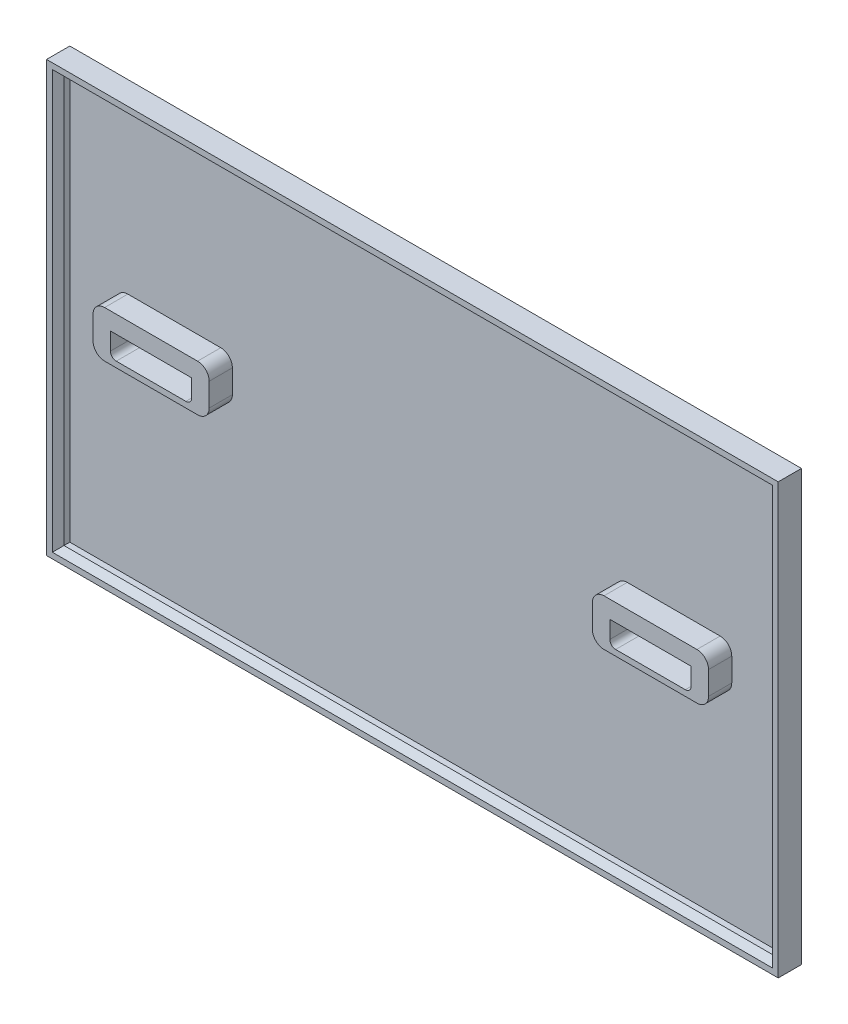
ISO-10303-21;
HEADER;
FILE_DESCRIPTION(('STEP AP214'),'2;1');
FILE_NAME('part.step','',(''),(''),'','','');
FILE_SCHEMA(('AUTOMOTIVE_DESIGN { 1 0 10303 214 1 1 1 1 }'));
ENDSEC;
DATA;
#1=APPLICATION_CONTEXT('core data for automotive mechanical design processes');
#2=APPLICATION_PROTOCOL_DEFINITION('international standard','automotive_design',2000,#1);
#3=PRODUCT_CONTEXT('',#1,'mechanical');
#4=PRODUCT('Part','Part','',(#3));
#5=PRODUCT_RELATED_PRODUCT_CATEGORY('part','',(#4));
#6=PRODUCT_DEFINITION_FORMATION('','',#4);
#7=PRODUCT_DEFINITION_CONTEXT('part definition',#1,'design');
#8=PRODUCT_DEFINITION('design','',#6,#7);
#9=PRODUCT_DEFINITION_SHAPE('','',#8);
#10=(LENGTH_UNIT() NAMED_UNIT(*) SI_UNIT(.MILLI.,.METRE.));
#11=(NAMED_UNIT(*) PLANE_ANGLE_UNIT() SI_UNIT($,.RADIAN.));
#12=(NAMED_UNIT(*) SI_UNIT($,.STERADIAN.) SOLID_ANGLE_UNIT());
#13=UNCERTAINTY_MEASURE_WITH_UNIT(LENGTH_MEASURE(1.E-05),#10,'distance_accuracy_value','');
#14=(GEOMETRIC_REPRESENTATION_CONTEXT(3) GLOBAL_UNCERTAINTY_ASSIGNED_CONTEXT((#13)) GLOBAL_UNIT_ASSIGNED_CONTEXT((#10,
#11,#12)) REPRESENTATION_CONTEXT('',''));
#15=CARTESIAN_POINT('',(0.,0.,0.));
#16=DIRECTION('',(0.,0.,1.));
#17=DIRECTION('',(1.,0.,0.));
#18=AXIS2_PLACEMENT_3D('',#15,#16,#17);
#19=CARTESIAN_POINT('',(0.,-370.,10.));
#20=DIRECTION('',(0.,0.,1.));
#21=DIRECTION('',(1.,0.,0.));
#22=AXIS2_PLACEMENT_3D('',#19,#20,#21);
#23=PLANE('',#22);
#24=DIRECTION('',(0.,1.,0.));
#25=VECTOR('',#24,1.);
#26=CARTESIAN_POINT('',(150.,-160.,10.));
#27=LINE('',#26,#25);
#28=CARTESIAN_POINT('',(150.,-180.,10.));
#29=VERTEX_POINT('',#28);
#30=CARTESIAN_POINT('',(150.,-160.,10.));
#31=VERTEX_POINT('',#30);
#32=EDGE_CURVE('E482',#29,#31,#27,.T.);
#33=ORIENTED_EDGE('',*,*,#32,.F.);
#34=CARTESIAN_POINT('',(140.,-180.,10.));
#35=DIRECTION('',(0.,0.,1.));
#36=DIRECTION('',(-1.,0.,0.));
#37=AXIS2_PLACEMENT_3D('',#34,#35,#36);
#38=CIRCLE('',#37,10.);
#39=CARTESIAN_POINT('',(140.,-190.,10.));
#40=VERTEX_POINT('',#39);
#41=EDGE_CURVE('E460',#40,#29,#38,.T.);
#42=ORIENTED_EDGE('',*,*,#41,.F.);
#43=DIRECTION('',(1.,0.,0.));
#44=VECTOR('',#43,1.);
#45=CARTESIAN_POINT('',(60.,-190.,10.));
#46=LINE('',#45,#44);
#47=CARTESIAN_POINT('',(60.,-190.,10.));
#48=VERTEX_POINT('',#47);
#49=EDGE_CURVE('E465',#48,#40,#46,.T.);
#50=ORIENTED_EDGE('',*,*,#49,.F.);
#51=CARTESIAN_POINT('',(60.,-180.,10.));
#52=DIRECTION('',(0.,0.,1.));
#53=DIRECTION('',(1.,0.,0.));
#54=AXIS2_PLACEMENT_3D('',#51,#52,#53);
#55=CIRCLE('',#54,10.);
#56=CARTESIAN_POINT('',(50.,-180.,10.));
#57=VERTEX_POINT('',#56);
#58=EDGE_CURVE('E492',#57,#48,#55,.T.);
#59=ORIENTED_EDGE('',*,*,#58,.F.);
#60=DIRECTION('',(0.,-1.,0.));
#61=VECTOR('',#60,1.);
#62=CARTESIAN_POINT('',(50.,-160.,10.));
#63=LINE('',#62,#61);
#64=CARTESIAN_POINT('',(50.,-160.,10.));
#65=VERTEX_POINT('',#64);
#66=EDGE_CURVE('E490',#65,#57,#63,.T.);
#67=ORIENTED_EDGE('',*,*,#66,.F.);
#68=CARTESIAN_POINT('',(60.,-160.,10.));
#69=DIRECTION('',(0.,0.,1.));
#70=DIRECTION('',(1.,0.,0.));
#71=AXIS2_PLACEMENT_3D('',#68,#69,#70);
#72=CIRCLE('',#71,10.);
#73=CARTESIAN_POINT('',(60.,-150.,10.));
#74=VERTEX_POINT('',#73);
#75=EDGE_CURVE('E488',#74,#65,#72,.T.);
#76=ORIENTED_EDGE('',*,*,#75,.F.);
#77=DIRECTION('',(-1.,0.,0.));
#78=VECTOR('',#77,1.);
#79=CARTESIAN_POINT('',(60.,-150.,10.));
#80=LINE('',#79,#78);
#81=CARTESIAN_POINT('',(140.,-150.,10.));
#82=VERTEX_POINT('',#81);
#83=EDGE_CURVE('E486',#82,#74,#80,.T.);
#84=ORIENTED_EDGE('',*,*,#83,.F.);
#85=CARTESIAN_POINT('',(140.,-160.,10.));
#86=DIRECTION('',(0.,0.,1.));
#87=DIRECTION('',(1.,0.,0.));
#88=AXIS2_PLACEMENT_3D('',#85,#86,#87);
#89=CIRCLE('',#88,10.);
#90=EDGE_CURVE('E484',#31,#82,#89,.T.);
#91=ORIENTED_EDGE('',*,*,#90,.F.);
#92=EDGE_LOOP('',(#33,#42,#50,#59,#67,#76,#84,#91));
#93=FACE_BOUND('',#92,.T.);
#94=DIRECTION('',(0.,-1.,0.));
#95=VECTOR('',#94,1.);
#96=CARTESIAN_POINT('',(10.,0.,10.));
#97=LINE('',#96,#95);
#98=CARTESIAN_POINT('',(10.,-10.,10.));
#99=VERTEX_POINT('',#98);
#100=CARTESIAN_POINT('',(10.,-360.,10.));
#101=VERTEX_POINT('',#100);
#102=EDGE_CURVE('E550',#99,#101,#97,.T.);
#103=ORIENTED_EDGE('',*,*,#102,.T.);
#104=DIRECTION('',(1.,0.,0.));
#105=VECTOR('',#104,1.);
#106=CARTESIAN_POINT('',(0.,-360.,10.));
#107=LINE('',#106,#105);
#108=CARTESIAN_POINT('',(620.,-360.,10.));
#109=VERTEX_POINT('',#108);
#110=EDGE_CURVE('E553',#101,#109,#107,.T.);
#111=ORIENTED_EDGE('',*,*,#110,.T.);
#112=DIRECTION('',(0.,1.,0.));
#113=VECTOR('',#112,1.);
#114=CARTESIAN_POINT('',(620.,0.,10.));
#115=LINE('',#114,#113);
#116=CARTESIAN_POINT('',(620.,-10.,10.));
#117=VERTEX_POINT('',#116);
#118=EDGE_CURVE('E564',#109,#117,#115,.T.);
#119=ORIENTED_EDGE('',*,*,#118,.T.);
#120=DIRECTION('',(-1.,0.,0.));
#121=VECTOR('',#120,1.);
#122=CARTESIAN_POINT('',(0.,-10.,10.));
#123=LINE('',#122,#121);
#124=EDGE_CURVE('E561',#117,#99,#123,.T.);
#125=ORIENTED_EDGE('',*,*,#124,.T.);
#126=EDGE_LOOP('',(#103,#111,#119,#125));
#127=FACE_BOUND('',#126,.T.);
#128=DIRECTION('',(0.,1.,0.));
#129=VECTOR('',#128,1.);
#130=CARTESIAN_POINT('',(580.,-160.,10.));
#131=LINE('',#130,#129);
#132=CARTESIAN_POINT('',(580.,-180.,10.));
#133=VERTEX_POINT('',#132);
#134=CARTESIAN_POINT('',(580.,-160.,10.));
#135=VERTEX_POINT('',#134);
#136=EDGE_CURVE('E425',#133,#135,#131,.T.);
#137=ORIENTED_EDGE('',*,*,#136,.F.);
#138=CARTESIAN_POINT('',(570.,-180.,10.));
#139=DIRECTION('',(0.,0.,1.));
#140=DIRECTION('',(-1.,0.,0.));
#141=AXIS2_PLACEMENT_3D('',#138,#139,#140);
#142=CIRCLE('',#141,9.99999999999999);
#143=CARTESIAN_POINT('',(570.,-190.,10.));
#144=VERTEX_POINT('',#143);
#145=EDGE_CURVE('E394',#144,#133,#142,.T.);
#146=ORIENTED_EDGE('',*,*,#145,.F.);
#147=DIRECTION('',(1.,0.,0.));
#148=VECTOR('',#147,1.);
#149=CARTESIAN_POINT('',(490.,-190.,10.));
#150=LINE('',#149,#148);
#151=CARTESIAN_POINT('',(490.,-190.,10.));
#152=VERTEX_POINT('',#151);
#153=EDGE_CURVE('E408',#152,#144,#150,.T.);
#154=ORIENTED_EDGE('',*,*,#153,.F.);
#155=CARTESIAN_POINT('',(490.,-180.,10.));
#156=DIRECTION('',(0.,0.,1.));
#157=DIRECTION('',(1.,0.,0.));
#158=AXIS2_PLACEMENT_3D('',#155,#156,#157);
#159=CIRCLE('',#158,10.);
#160=CARTESIAN_POINT('',(480.,-180.,10.));
#161=VERTEX_POINT('',#160);
#162=EDGE_CURVE('E435',#161,#152,#159,.T.);
#163=ORIENTED_EDGE('',*,*,#162,.F.);
#164=DIRECTION('',(0.,-1.,0.));
#165=VECTOR('',#164,1.);
#166=CARTESIAN_POINT('',(480.,-160.,10.));
#167=LINE('',#166,#165);
#168=CARTESIAN_POINT('',(480.,-160.,10.));
#169=VERTEX_POINT('',#168);
#170=EDGE_CURVE('E433',#169,#161,#167,.T.);
#171=ORIENTED_EDGE('',*,*,#170,.F.);
#172=CARTESIAN_POINT('',(490.,-160.,10.));
#173=DIRECTION('',(0.,0.,1.));
#174=DIRECTION('',(-1.,0.,0.));
#175=AXIS2_PLACEMENT_3D('',#172,#173,#174);
#176=CIRCLE('',#175,9.99999999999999);
#177=CARTESIAN_POINT('',(490.,-150.,10.));
#178=VERTEX_POINT('',#177);
#179=EDGE_CURVE('E431',#178,#169,#176,.T.);
#180=ORIENTED_EDGE('',*,*,#179,.F.);
#181=DIRECTION('',(-1.,0.,0.));
#182=VECTOR('',#181,1.);
#183=CARTESIAN_POINT('',(490.,-150.,10.));
#184=LINE('',#183,#182);
#185=CARTESIAN_POINT('',(570.,-150.,10.));
#186=VERTEX_POINT('',#185);
#187=EDGE_CURVE('E429',#186,#178,#184,.T.);
#188=ORIENTED_EDGE('',*,*,#187,.F.);
#189=CARTESIAN_POINT('',(570.,-160.,10.));
#190=DIRECTION('',(0.,0.,1.));
#191=DIRECTION('',(1.,0.,0.));
#192=AXIS2_PLACEMENT_3D('',#189,#190,#191);
#193=CIRCLE('',#192,10.);
#194=EDGE_CURVE('E427',#135,#186,#193,.T.);
#195=ORIENTED_EDGE('',*,*,#194,.F.);
#196=EDGE_LOOP('',(#137,#146,#154,#163,#171,#180,#188,#195));
#197=FACE_BOUND('',#196,.T.);
#198=ADVANCED_FACE('F33',(#93,#127,#197),#23,.T.);
#199=CARTESIAN_POINT('',(0.,0.,20.));
#200=DIRECTION('',(1.,0.,0.));
#201=DIRECTION('',(0.,1.,0.));
#202=AXIS2_PLACEMENT_3D('',#199,#200,#201);
#203=PLANE('',#202);
#204=DIRECTION('',(0.,-1.,0.));
#205=VECTOR('',#204,1.);
#206=CARTESIAN_POINT('',(0.,0.,0.));
#207=LINE('',#206,#205);
#208=CARTESIAN_POINT('',(0.,0.,0.));
#209=VERTEX_POINT('',#208);
#210=CARTESIAN_POINT('',(0.,-370.,0.));
#211=VERTEX_POINT('',#210);
#212=EDGE_CURVE('E556',#209,#211,#207,.T.);
#213=ORIENTED_EDGE('',*,*,#212,.T.);
#214=DIRECTION('',(0.,0.,-1.));
#215=VECTOR('',#214,1.);
#216=CARTESIAN_POINT('',(0.,-370.,20.));
#217=LINE('',#216,#215);
#218=CARTESIAN_POINT('',(0.,-370.,20.));
#219=VERTEX_POINT('',#218);
#220=EDGE_CURVE('E597',#219,#211,#217,.T.);
#221=ORIENTED_EDGE('',*,*,#220,.F.);
#222=DIRECTION('',(0.,-1.,0.));
#223=VECTOR('',#222,1.);
#224=CARTESIAN_POINT('',(0.,0.,20.));
#225=LINE('',#224,#223);
#226=CARTESIAN_POINT('',(0.,0.,20.));
#227=VERTEX_POINT('',#226);
#228=EDGE_CURVE('E571',#227,#219,#225,.T.);
#229=ORIENTED_EDGE('',*,*,#228,.F.);
#230=DIRECTION('',(0.,0.,-1.));
#231=VECTOR('',#230,1.);
#232=CARTESIAN_POINT('',(0.,0.,20.));
#233=LINE('',#232,#231);
#234=EDGE_CURVE('E581',#227,#209,#233,.T.);
#235=ORIENTED_EDGE('',*,*,#234,.T.);
#236=EDGE_LOOP('',(#213,#221,#229,#235));
#237=FACE_BOUND('',#236,.T.);
#238=ADVANCED_FACE('F672',(#237),#203,.F.);
#239=CARTESIAN_POINT('',(0.,-370.,20.));
#240=DIRECTION('',(0.,1.,0.));
#241=DIRECTION('',(0.,0.,1.));
#242=AXIS2_PLACEMENT_3D('',#239,#240,#241);
#243=PLANE('',#242);
#244=DIRECTION('',(1.,0.,0.));
#245=VECTOR('',#244,1.);
#246=CARTESIAN_POINT('',(0.,-370.,0.));
#247=LINE('',#246,#245);
#248=CARTESIAN_POINT('',(630.,-370.,0.));
#249=VERTEX_POINT('',#248);
#250=EDGE_CURVE('E584',#211,#249,#247,.T.);
#251=ORIENTED_EDGE('',*,*,#250,.T.);
#252=DIRECTION('',(0.,0.,-1.));
#253=VECTOR('',#252,1.);
#254=CARTESIAN_POINT('',(630.,-370.,20.));
#255=LINE('',#254,#253);
#256=CARTESIAN_POINT('',(630.,-370.,20.));
#257=VERTEX_POINT('',#256);
#258=EDGE_CURVE('E594',#257,#249,#255,.T.);
#259=ORIENTED_EDGE('',*,*,#258,.F.);
#260=DIRECTION('',(1.,0.,0.));
#261=VECTOR('',#260,1.);
#262=CARTESIAN_POINT('',(0.,-370.,20.));
#263=LINE('',#262,#261);
#264=EDGE_CURVE('E574',#219,#257,#263,.T.);
#265=ORIENTED_EDGE('',*,*,#264,.F.);
#266=ORIENTED_EDGE('',*,*,#220,.T.);
#267=EDGE_LOOP('',(#251,#259,#265,#266));
#268=FACE_BOUND('',#267,.T.);
#269=ADVANCED_FACE('F678',(#268),#243,.F.);
#270=CARTESIAN_POINT('',(630.,0.,20.));
#271=DIRECTION('',(-1.,0.,0.));
#272=DIRECTION('',(0.,0.,1.));
#273=AXIS2_PLACEMENT_3D('',#270,#271,#272);
#274=PLANE('',#273);
#275=DIRECTION('',(0.,1.,0.));
#276=VECTOR('',#275,1.);
#277=CARTESIAN_POINT('',(630.,0.,0.));
#278=LINE('',#277,#276);
#279=CARTESIAN_POINT('',(630.,0.,0.));
#280=VERTEX_POINT('',#279);
#281=EDGE_CURVE('E586',#249,#280,#278,.T.);
#282=ORIENTED_EDGE('',*,*,#281,.T.);
#283=DIRECTION('',(0.,0.,-1.));
#284=VECTOR('',#283,1.);
#285=CARTESIAN_POINT('',(630.,0.,20.));
#286=LINE('',#285,#284);
#287=CARTESIAN_POINT('',(630.,0.,20.));
#288=VERTEX_POINT('',#287);
#289=EDGE_CURVE('E591',#288,#280,#286,.T.);
#290=ORIENTED_EDGE('',*,*,#289,.F.);
#291=DIRECTION('',(0.,1.,0.));
#292=VECTOR('',#291,1.);
#293=CARTESIAN_POINT('',(630.,0.,20.));
#294=LINE('',#293,#292);
#295=EDGE_CURVE('E577',#257,#288,#294,.T.);
#296=ORIENTED_EDGE('',*,*,#295,.F.);
#297=ORIENTED_EDGE('',*,*,#258,.T.);
#298=EDGE_LOOP('',(#282,#290,#296,#297));
#299=FACE_BOUND('',#298,.T.);
#300=ADVANCED_FACE('F690',(#299),#274,.F.);
#301=CARTESIAN_POINT('',(0.,0.,20.));
#302=DIRECTION('',(0.,-1.,0.));
#303=DIRECTION('',(0.,0.,-1.));
#304=AXIS2_PLACEMENT_3D('',#301,#302,#303);
#305=PLANE('',#304);
#306=DIRECTION('',(-1.,0.,0.));
#307=VECTOR('',#306,1.);
#308=CARTESIAN_POINT('',(0.,0.,0.));
#309=LINE('',#308,#307);
#310=EDGE_CURVE('E575',#280,#209,#309,.T.);
#311=ORIENTED_EDGE('',*,*,#310,.T.);
#312=ORIENTED_EDGE('',*,*,#234,.F.);
#313=DIRECTION('',(-1.,0.,0.));
#314=VECTOR('',#313,1.);
#315=CARTESIAN_POINT('',(0.,0.,20.));
#316=LINE('',#315,#314);
#317=EDGE_CURVE('E579',#288,#227,#316,.T.);
#318=ORIENTED_EDGE('',*,*,#317,.F.);
#319=ORIENTED_EDGE('',*,*,#289,.T.);
#320=EDGE_LOOP('',(#311,#312,#318,#319));
#321=FACE_BOUND('',#320,.T.);
#322=ADVANCED_FACE('F686',(#321),#305,.F.);
#323=CARTESIAN_POINT('',(0.,-370.,20.));
#324=DIRECTION('',(0.,0.,1.));
#325=DIRECTION('',(1.,0.,0.));
#326=AXIS2_PLACEMENT_3D('',#323,#324,#325);
#327=PLANE('',#326);
#328=DIRECTION('',(0.,-1.,0.));
#329=VECTOR('',#328,1.);
#330=CARTESIAN_POINT('',(625.,-370.,20.));
#331=LINE('',#330,#329);
#332=CARTESIAN_POINT('',(625.,-4.99999999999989,20.));
#333=VERTEX_POINT('',#332);
#334=CARTESIAN_POINT('',(625.,-365.,20.));
#335=VERTEX_POINT('',#334);
#336=EDGE_CURVE('E607',#333,#335,#331,.T.);
#337=ORIENTED_EDGE('',*,*,#336,.T.);
#338=DIRECTION('',(-1.,0.,0.));
#339=VECTOR('',#338,1.);
#340=CARTESIAN_POINT('',(0.,-365.,20.));
#341=LINE('',#340,#339);
#342=CARTESIAN_POINT('',(4.99999999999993,-365.,20.));
#343=VERTEX_POINT('',#342);
#344=EDGE_CURVE('E609',#335,#343,#341,.T.);
#345=ORIENTED_EDGE('',*,*,#344,.T.);
#346=DIRECTION('',(0.,1.,0.));
#347=VECTOR('',#346,1.);
#348=CARTESIAN_POINT('',(4.99999999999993,-370.,20.));
#349=LINE('',#348,#347);
#350=CARTESIAN_POINT('',(4.99999999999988,-4.99999999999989,20.));
#351=VERTEX_POINT('',#350);
#352=EDGE_CURVE('E605',#343,#351,#349,.T.);
#353=ORIENTED_EDGE('',*,*,#352,.T.);
#354=DIRECTION('',(1.,0.,0.));
#355=VECTOR('',#354,1.);
#356=CARTESIAN_POINT('',(0.,-4.99999999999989,20.));
#357=LINE('',#356,#355);
#358=EDGE_CURVE('E603',#351,#333,#357,.T.);
#359=ORIENTED_EDGE('',*,*,#358,.T.);
#360=EDGE_LOOP('',(#337,#345,#353,#359));
#361=FACE_BOUND('',#360,.T.);
#362=ORIENTED_EDGE('',*,*,#228,.T.);
#363=ORIENTED_EDGE('',*,*,#264,.T.);
#364=ORIENTED_EDGE('',*,*,#295,.T.);
#365=ORIENTED_EDGE('',*,*,#317,.T.);
#366=EDGE_LOOP('',(#362,#363,#364,#365));
#367=FACE_BOUND('',#366,.T.);
#368=ADVANCED_FACE('F634',(#361,#367),#327,.T.);
#369=CARTESIAN_POINT('',(0.,-370.,0.));
#370=DIRECTION('',(0.,0.,1.));
#371=DIRECTION('',(1.,0.,0.));
#372=AXIS2_PLACEMENT_3D('',#369,#370,#371);
#373=PLANE('',#372);
#374=DIRECTION('',(-1.,0.,0.));
#375=VECTOR('',#374,1.);
#376=CARTESIAN_POINT('',(0.,-10.,0.));
#377=LINE('',#376,#375);
#378=CARTESIAN_POINT('',(620.,-10.,0.));
#379=VERTEX_POINT('',#378);
#380=CARTESIAN_POINT('',(10.,-10.,0.));
#381=VERTEX_POINT('',#380);
#382=EDGE_CURVE('E525',#379,#381,#377,.T.);
#383=ORIENTED_EDGE('',*,*,#382,.T.);
#384=DIRECTION('',(0.,-1.,0.));
#385=VECTOR('',#384,1.);
#386=CARTESIAN_POINT('',(10.,0.,0.));
#387=LINE('',#386,#385);
#388=CARTESIAN_POINT('',(10.,-360.,0.));
#389=VERTEX_POINT('',#388);
#390=EDGE_CURVE('E529',#381,#389,#387,.T.);
#391=ORIENTED_EDGE('',*,*,#390,.T.);
#392=DIRECTION('',(1.,0.,0.));
#393=VECTOR('',#392,1.);
#394=CARTESIAN_POINT('',(0.,-360.,0.));
#395=LINE('',#394,#393);
#396=CARTESIAN_POINT('',(620.,-360.,0.));
#397=VERTEX_POINT('',#396);
#398=EDGE_CURVE('E532',#389,#397,#395,.T.);
#399=ORIENTED_EDGE('',*,*,#398,.T.);
#400=DIRECTION('',(0.,1.,0.));
#401=VECTOR('',#400,1.);
#402=CARTESIAN_POINT('',(620.,0.,0.));
#403=LINE('',#402,#401);
#404=EDGE_CURVE('E535',#397,#379,#403,.T.);
#405=ORIENTED_EDGE('',*,*,#404,.T.);
#406=EDGE_LOOP('',(#383,#391,#399,#405));
#407=FACE_BOUND('',#406,.T.);
#408=ORIENTED_EDGE('',*,*,#212,.F.);
#409=ORIENTED_EDGE('',*,*,#310,.F.);
#410=ORIENTED_EDGE('',*,*,#281,.F.);
#411=ORIENTED_EDGE('',*,*,#250,.F.);
#412=EDGE_LOOP('',(#408,#409,#410,#411));
#413=FACE_BOUND('',#412,.T.);
#414=ADVANCED_FACE('F661',(#407,#413),#373,.F.);
#415=CARTESIAN_POINT('',(10.,0.,20.));
#416=DIRECTION('',(1.,0.,0.));
#417=DIRECTION('',(0.,1.,0.));
#418=AXIS2_PLACEMENT_3D('',#415,#416,#417);
#419=PLANE('',#418);
#420=DIRECTION('',(0.,0.,-1.));
#421=VECTOR('',#420,1.);
#422=CARTESIAN_POINT('',(10.,-10.,20.));
#423=LINE('',#422,#421);
#424=CARTESIAN_POINT('',(10.,-10.,14.9999999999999));
#425=VERTEX_POINT('',#424);
#426=EDGE_CURVE('E558',#425,#99,#423,.T.);
#427=ORIENTED_EDGE('',*,*,#426,.F.);
#428=DIRECTION('',(0.,-1.,0.));
#429=VECTOR('',#428,1.);
#430=CARTESIAN_POINT('',(10.,0.,14.9999999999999));
#431=LINE('',#430,#429);
#432=CARTESIAN_POINT('',(10.,-360.,14.9999999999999));
#433=VERTEX_POINT('',#432);
#434=EDGE_CURVE('E42',#425,#433,#431,.T.);
#435=ORIENTED_EDGE('',*,*,#434,.T.);
#436=DIRECTION('',(0.,0.,-1.));
#437=VECTOR('',#436,1.);
#438=CARTESIAN_POINT('',(10.,-360.,20.));
#439=LINE('',#438,#437);
#440=EDGE_CURVE('E554',#433,#101,#439,.T.);
#441=ORIENTED_EDGE('',*,*,#440,.T.);
#442=ORIENTED_EDGE('',*,*,#102,.F.);
#443=EDGE_LOOP('',(#427,#435,#441,#442));
#444=FACE_BOUND('',#443,.T.);
#445=ADVANCED_FACE('F659',(#444),#419,.T.);
#446=CARTESIAN_POINT('',(0.,-360.,20.));
#447=DIRECTION('',(0.,1.,0.));
#448=DIRECTION('',(0.,0.,1.));
#449=AXIS2_PLACEMENT_3D('',#446,#447,#448);
#450=PLANE('',#449);
#451=ORIENTED_EDGE('',*,*,#440,.F.);
#452=DIRECTION('',(1.,0.,0.));
#453=VECTOR('',#452,1.);
#454=CARTESIAN_POINT('',(0.,-360.,14.9999999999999));
#455=LINE('',#454,#453);
#456=CARTESIAN_POINT('',(620.,-360.,14.9999999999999));
#457=VERTEX_POINT('',#456);
#458=EDGE_CURVE('E600',#433,#457,#455,.T.);
#459=ORIENTED_EDGE('',*,*,#458,.T.);
#460=DIRECTION('',(0.,0.,-1.));
#461=VECTOR('',#460,1.);
#462=CARTESIAN_POINT('',(620.,-360.,20.));
#463=LINE('',#462,#461);
#464=EDGE_CURVE('E557',#457,#109,#463,.T.);
#465=ORIENTED_EDGE('',*,*,#464,.T.);
#466=ORIENTED_EDGE('',*,*,#110,.F.);
#467=EDGE_LOOP('',(#451,#459,#465,#466));
#468=FACE_BOUND('',#467,.T.);
#469=ADVANCED_FACE('F647',(#468),#450,.T.);
#470=CARTESIAN_POINT('',(620.,0.,20.));
#471=DIRECTION('',(-1.,0.,0.));
#472=DIRECTION('',(0.,0.,1.));
#473=AXIS2_PLACEMENT_3D('',#470,#471,#472);
#474=PLANE('',#473);
#475=ORIENTED_EDGE('',*,*,#464,.F.);
#476=DIRECTION('',(0.,1.,0.));
#477=VECTOR('',#476,1.);
#478=CARTESIAN_POINT('',(620.,0.,14.9999999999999));
#479=LINE('',#478,#477);
#480=CARTESIAN_POINT('',(620.,-10.,14.9999999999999));
#481=VERTEX_POINT('',#480);
#482=EDGE_CURVE('E612',#457,#481,#479,.T.);
#483=ORIENTED_EDGE('',*,*,#482,.T.);
#484=DIRECTION('',(0.,0.,-1.));
#485=VECTOR('',#484,1.);
#486=CARTESIAN_POINT('',(620.,-10.,20.));
#487=LINE('',#486,#485);
#488=EDGE_CURVE('E560',#481,#117,#487,.T.);
#489=ORIENTED_EDGE('',*,*,#488,.T.);
#490=ORIENTED_EDGE('',*,*,#118,.F.);
#491=EDGE_LOOP('',(#475,#483,#489,#490));
#492=FACE_BOUND('',#491,.T.);
#493=ADVANCED_FACE('F650',(#492),#474,.T.);
#494=CARTESIAN_POINT('',(0.,-10.,20.));
#495=DIRECTION('',(0.,-1.,0.));
#496=DIRECTION('',(0.,0.,-1.));
#497=AXIS2_PLACEMENT_3D('',#494,#495,#496);
#498=PLANE('',#497);
#499=ORIENTED_EDGE('',*,*,#488,.F.);
#500=DIRECTION('',(-1.,0.,0.));
#501=VECTOR('',#500,1.);
#502=CARTESIAN_POINT('',(0.,-10.,14.9999999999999));
#503=LINE('',#502,#501);
#504=EDGE_CURVE('E11',#481,#425,#503,.T.);
#505=ORIENTED_EDGE('',*,*,#504,.T.);
#506=ORIENTED_EDGE('',*,*,#426,.T.);
#507=ORIENTED_EDGE('',*,*,#124,.F.);
#508=EDGE_LOOP('',(#499,#505,#506,#507));
#509=FACE_BOUND('',#508,.T.);
#510=ADVANCED_FACE('F656',(#509),#498,.T.);
#511=CARTESIAN_POINT('',(0.,-370.,2.));
#512=DIRECTION('',(0.,0.,1.));
#513=DIRECTION('',(1.,0.,0.));
#514=AXIS2_PLACEMENT_3D('',#511,#512,#513);
#515=PLANE('',#514);
#516=DIRECTION('',(0.,1.,0.));
#517=VECTOR('',#516,1.);
#518=CARTESIAN_POINT('',(620.,0.,2.));
#519=LINE('',#518,#517);
#520=CARTESIAN_POINT('',(620.,-360.,2.));
#521=VERTEX_POINT('',#520);
#522=CARTESIAN_POINT('',(620.,-10.,2.));
#523=VERTEX_POINT('',#522);
#524=EDGE_CURVE('E545',#521,#523,#519,.T.);
#525=ORIENTED_EDGE('',*,*,#524,.F.);
#526=DIRECTION('',(1.,0.,0.));
#527=VECTOR('',#526,1.);
#528=CARTESIAN_POINT('',(0.,-360.,2.));
#529=LINE('',#528,#527);
#530=CARTESIAN_POINT('',(10.,-360.,2.));
#531=VERTEX_POINT('',#530);
#532=EDGE_CURVE('E542',#531,#521,#529,.T.);
#533=ORIENTED_EDGE('',*,*,#532,.F.);
#534=DIRECTION('',(0.,-1.,0.));
#535=VECTOR('',#534,1.);
#536=CARTESIAN_POINT('',(10.,0.,2.));
#537=LINE('',#536,#535);
#538=CARTESIAN_POINT('',(10.,-10.,2.));
#539=VERTEX_POINT('',#538);
#540=EDGE_CURVE('E520',#539,#531,#537,.T.);
#541=ORIENTED_EDGE('',*,*,#540,.F.);
#542=DIRECTION('',(-1.,0.,0.));
#543=VECTOR('',#542,1.);
#544=CARTESIAN_POINT('',(0.,-10.,2.));
#545=LINE('',#544,#543);
#546=EDGE_CURVE('E548',#523,#539,#545,.T.);
#547=ORIENTED_EDGE('',*,*,#546,.F.);
#548=EDGE_LOOP('',(#525,#533,#541,#547));
#549=FACE_BOUND('',#548,.T.);
#550=ADVANCED_FACE('F720',(#549),#515,.F.);
#551=CARTESIAN_POINT('',(10.,0.,20.));
#552=DIRECTION('',(1.,0.,0.));
#553=DIRECTION('',(0.,1.,0.));
#554=AXIS2_PLACEMENT_3D('',#551,#552,#553);
#555=PLANE('',#554);
#556=ORIENTED_EDGE('',*,*,#540,.T.);
#557=DIRECTION('',(0.,0.,-1.));
#558=VECTOR('',#557,1.);
#559=CARTESIAN_POINT('',(10.,-360.,20.));
#560=LINE('',#559,#558);
#561=EDGE_CURVE('E518',#531,#389,#560,.T.);
#562=ORIENTED_EDGE('',*,*,#561,.T.);
#563=ORIENTED_EDGE('',*,*,#390,.F.);
#564=DIRECTION('',(0.,0.,-1.));
#565=VECTOR('',#564,1.);
#566=CARTESIAN_POINT('',(10.,-10.,20.));
#567=LINE('',#566,#565);
#568=EDGE_CURVE('E522',#539,#381,#567,.T.);
#569=ORIENTED_EDGE('',*,*,#568,.F.);
#570=EDGE_LOOP('',(#556,#562,#563,#569));
#571=FACE_BOUND('',#570,.T.);
#572=ADVANCED_FACE('F722',(#571),#555,.T.);
#573=CARTESIAN_POINT('',(0.,-360.,20.));
#574=DIRECTION('',(0.,1.,0.));
#575=DIRECTION('',(0.,0.,1.));
#576=AXIS2_PLACEMENT_3D('',#573,#574,#575);
#577=PLANE('',#576);
#578=ORIENTED_EDGE('',*,*,#532,.T.);
#579=DIRECTION('',(0.,0.,-1.));
#580=VECTOR('',#579,1.);
#581=CARTESIAN_POINT('',(620.,-360.,20.));
#582=LINE('',#581,#580);
#583=EDGE_CURVE('E521',#521,#397,#582,.T.);
#584=ORIENTED_EDGE('',*,*,#583,.T.);
#585=ORIENTED_EDGE('',*,*,#398,.F.);
#586=ORIENTED_EDGE('',*,*,#561,.F.);
#587=EDGE_LOOP('',(#578,#584,#585,#586));
#588=FACE_BOUND('',#587,.T.);
#589=ADVANCED_FACE('F716',(#588),#577,.T.);
#590=CARTESIAN_POINT('',(620.,0.,20.));
#591=DIRECTION('',(-1.,0.,0.));
#592=DIRECTION('',(0.,0.,1.));
#593=AXIS2_PLACEMENT_3D('',#590,#591,#592);
#594=PLANE('',#593);
#595=ORIENTED_EDGE('',*,*,#524,.T.);
#596=DIRECTION('',(0.,0.,-1.));
#597=VECTOR('',#596,1.);
#598=CARTESIAN_POINT('',(620.,-10.,20.));
#599=LINE('',#598,#597);
#600=EDGE_CURVE('E524',#523,#379,#599,.T.);
#601=ORIENTED_EDGE('',*,*,#600,.T.);
#602=ORIENTED_EDGE('',*,*,#404,.F.);
#603=ORIENTED_EDGE('',*,*,#583,.F.);
#604=EDGE_LOOP('',(#595,#601,#602,#603));
#605=FACE_BOUND('',#604,.T.);
#606=ADVANCED_FACE('F710',(#605),#594,.T.);
#607=CARTESIAN_POINT('',(0.,-10.,20.));
#608=DIRECTION('',(0.,-1.,0.));
#609=DIRECTION('',(0.,0.,-1.));
#610=AXIS2_PLACEMENT_3D('',#607,#608,#609);
#611=PLANE('',#610);
#612=ORIENTED_EDGE('',*,*,#546,.T.);
#613=ORIENTED_EDGE('',*,*,#568,.T.);
#614=ORIENTED_EDGE('',*,*,#382,.F.);
#615=ORIENTED_EDGE('',*,*,#600,.F.);
#616=EDGE_LOOP('',(#612,#613,#614,#615));
#617=FACE_BOUND('',#616,.T.);
#618=ADVANCED_FACE('F706',(#617),#611,.T.);
#619=CARTESIAN_POINT('',(0.,-10.,14.9999999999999));
#620=DIRECTION('',(0.,0.707106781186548,-0.707106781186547));
#621=DIRECTION('',(0.,0.707106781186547,0.707106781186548));
#622=AXIS2_PLACEMENT_3D('',#619,#620,#621);
#623=PLANE('',#622);
#624=DIRECTION('',(0.577350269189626,0.577350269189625,0.577350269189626));
#625=VECTOR('',#624,1.);
#626=CARTESIAN_POINT('',(623.333333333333,-6.66666666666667,18.3333333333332));
#627=LINE('',#626,#625);
#628=EDGE_CURVE('E617',#333,#481,#627,.F.);
#629=ORIENTED_EDGE('',*,*,#628,.F.);
#630=ORIENTED_EDGE('',*,*,#358,.F.);
#631=DIRECTION('',(0.577350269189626,-0.577350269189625,-0.577350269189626));
#632=VECTOR('',#631,1.);
#633=CARTESIAN_POINT('',(6.66666666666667,-6.66666666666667,18.3333333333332));
#634=LINE('',#633,#632);
#635=EDGE_CURVE('E37',#425,#351,#634,.F.);
#636=ORIENTED_EDGE('',*,*,#635,.F.);
#637=ORIENTED_EDGE('',*,*,#504,.F.);
#638=EDGE_LOOP('',(#629,#630,#636,#637));
#639=FACE_BOUND('',#638,.T.);
#640=ADVANCED_FACE('F35',(#639),#623,.F.);
#641=CARTESIAN_POINT('',(10.,0.,14.9999999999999));
#642=DIRECTION('',(-0.707106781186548,0.,-0.707106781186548));
#643=DIRECTION('',(-0.707106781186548,0.,0.707106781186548));
#644=AXIS2_PLACEMENT_3D('',#641,#642,#643);
#645=PLANE('',#644);
#646=ORIENTED_EDGE('',*,*,#635,.T.);
#647=ORIENTED_EDGE('',*,*,#352,.F.);
#648=DIRECTION('',(0.577350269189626,0.577350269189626,-0.577350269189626));
#649=VECTOR('',#648,1.);
#650=CARTESIAN_POINT('',(6.66666666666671,-363.333333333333,18.3333333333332));
#651=LINE('',#650,#649);
#652=EDGE_CURVE('E616',#433,#343,#651,.F.);
#653=ORIENTED_EDGE('',*,*,#652,.F.);
#654=ORIENTED_EDGE('',*,*,#434,.F.);
#655=EDGE_LOOP('',(#646,#647,#653,#654));
#656=FACE_BOUND('',#655,.T.);
#657=ADVANCED_FACE('F628',(#656),#645,.F.);
#658=CARTESIAN_POINT('',(620.,0.,14.9999999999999));
#659=DIRECTION('',(0.707106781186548,0.,-0.707106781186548));
#660=DIRECTION('',(-0.707106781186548,0.,-0.707106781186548));
#661=AXIS2_PLACEMENT_3D('',#658,#659,#660);
#662=PLANE('',#661);
#663=ORIENTED_EDGE('',*,*,#628,.T.);
#664=ORIENTED_EDGE('',*,*,#482,.F.);
#665=DIRECTION('',(0.577350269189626,-0.577350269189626,0.577350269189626));
#666=VECTOR('',#665,1.);
#667=CARTESIAN_POINT('',(413.333333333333,-153.333333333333,-191.666666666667));
#668=LINE('',#667,#666);
#669=EDGE_CURVE('E517',#335,#457,#668,.F.);
#670=ORIENTED_EDGE('',*,*,#669,.F.);
#671=ORIENTED_EDGE('',*,*,#336,.F.);
#672=EDGE_LOOP('',(#663,#664,#670,#671));
#673=FACE_BOUND('',#672,.T.);
#674=ADVANCED_FACE('F641',(#673),#662,.F.);
#675=CARTESIAN_POINT('',(0.,-360.,14.9999999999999));
#676=DIRECTION('',(0.,-0.707106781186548,-0.707106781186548));
#677=DIRECTION('',(0.,0.707106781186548,-0.707106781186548));
#678=AXIS2_PLACEMENT_3D('',#675,#676,#677);
#679=PLANE('',#678);
#680=ORIENTED_EDGE('',*,*,#652,.T.);
#681=ORIENTED_EDGE('',*,*,#344,.F.);
#682=ORIENTED_EDGE('',*,*,#669,.T.);
#683=ORIENTED_EDGE('',*,*,#458,.F.);
#684=EDGE_LOOP('',(#680,#681,#682,#683));
#685=FACE_BOUND('',#684,.T.);
#686=ADVANCED_FACE('F639',(#685),#679,.F.);
#687=CARTESIAN_POINT('',(140.,-180.,30.));
#688=DIRECTION('',(0.,0.,-1.));
#689=DIRECTION('',(-1.,0.,0.));
#690=AXIS2_PLACEMENT_3D('',#687,#688,#689);
#691=CYLINDRICAL_SURFACE('',#690,10.);
#692=ORIENTED_EDGE('',*,*,#41,.T.);
#693=DIRECTION('',(0.,0.,-1.));
#694=VECTOR('',#693,1.);
#695=CARTESIAN_POINT('',(150.,-180.,30.));
#696=LINE('',#695,#694);
#697=CARTESIAN_POINT('',(150.,-180.,30.));
#698=VERTEX_POINT('',#697);
#699=EDGE_CURVE('E515',#698,#29,#696,.T.);
#700=ORIENTED_EDGE('',*,*,#699,.F.);
#701=CARTESIAN_POINT('',(140.,-180.,30.));
#702=DIRECTION('',(0.,0.,1.));
#703=DIRECTION('',(-1.,0.,0.));
#704=AXIS2_PLACEMENT_3D('',#701,#702,#703);
#705=CIRCLE('',#704,10.);
#706=CARTESIAN_POINT('',(140.,-190.,30.));
#707=VERTEX_POINT('',#706);
#708=EDGE_CURVE('E461',#707,#698,#705,.T.);
#709=ORIENTED_EDGE('',*,*,#708,.F.);
#710=DIRECTION('',(0.,0.,-1.));
#711=VECTOR('',#710,1.);
#712=CARTESIAN_POINT('',(140.,-190.,30.));
#713=LINE('',#712,#711);
#714=EDGE_CURVE('E479',#707,#40,#713,.T.);
#715=ORIENTED_EDGE('',*,*,#714,.T.);
#716=EDGE_LOOP('',(#692,#700,#709,#715));
#717=FACE_BOUND('',#716,.T.);
#718=ADVANCED_FACE('F700',(#717),#691,.T.);
#719=CARTESIAN_POINT('',(150.,-160.,30.));
#720=DIRECTION('',(-1.,0.,0.));
#721=DIRECTION('',(0.,0.,1.));
#722=AXIS2_PLACEMENT_3D('',#719,#720,#721);
#723=PLANE('',#722);
#724=ORIENTED_EDGE('',*,*,#32,.T.);
#725=DIRECTION('',(0.,0.,-1.));
#726=VECTOR('',#725,1.);
#727=CARTESIAN_POINT('',(150.,-160.,30.));
#728=LINE('',#727,#726);
#729=CARTESIAN_POINT('',(150.,-160.,30.));
#730=VERTEX_POINT('',#729);
#731=EDGE_CURVE('E512',#730,#31,#728,.T.);
#732=ORIENTED_EDGE('',*,*,#731,.F.);
#733=DIRECTION('',(0.,1.,0.));
#734=VECTOR('',#733,1.);
#735=CARTESIAN_POINT('',(150.,-160.,30.));
#736=LINE('',#735,#734);
#737=EDGE_CURVE('E464',#698,#730,#736,.T.);
#738=ORIENTED_EDGE('',*,*,#737,.F.);
#739=ORIENTED_EDGE('',*,*,#699,.T.);
#740=EDGE_LOOP('',(#724,#732,#738,#739));
#741=FACE_BOUND('',#740,.T.);
#742=ADVANCED_FACE('F756',(#741),#723,.F.);
#743=CARTESIAN_POINT('',(140.,-160.,30.));
#744=DIRECTION('',(0.,0.,-1.));
#745=DIRECTION('',(-1.,0.,0.));
#746=AXIS2_PLACEMENT_3D('',#743,#744,#745);
#747=CYLINDRICAL_SURFACE('',#746,10.);
#748=ORIENTED_EDGE('',*,*,#90,.T.);
#749=DIRECTION('',(0.,0.,-1.));
#750=VECTOR('',#749,1.);
#751=CARTESIAN_POINT('',(140.,-150.,30.));
#752=LINE('',#751,#750);
#753=CARTESIAN_POINT('',(140.,-150.,30.));
#754=VERTEX_POINT('',#753);
#755=EDGE_CURVE('E509',#754,#82,#752,.T.);
#756=ORIENTED_EDGE('',*,*,#755,.F.);
#757=CARTESIAN_POINT('',(140.,-160.,30.));
#758=DIRECTION('',(0.,0.,1.));
#759=DIRECTION('',(1.,0.,0.));
#760=AXIS2_PLACEMENT_3D('',#757,#758,#759);
#761=CIRCLE('',#760,10.);
#762=EDGE_CURVE('E467',#730,#754,#761,.T.);
#763=ORIENTED_EDGE('',*,*,#762,.F.);
#764=ORIENTED_EDGE('',*,*,#731,.T.);
#765=EDGE_LOOP('',(#748,#756,#763,#764));
#766=FACE_BOUND('',#765,.T.);
#767=ADVANCED_FACE('F760',(#766),#747,.T.);
#768=CARTESIAN_POINT('',(60.,-150.,30.));
#769=DIRECTION('',(0.,-1.,0.));
#770=DIRECTION('',(0.,0.,-1.));
#771=AXIS2_PLACEMENT_3D('',#768,#769,#770);
#772=PLANE('',#771);
#773=ORIENTED_EDGE('',*,*,#83,.T.);
#774=DIRECTION('',(0.,0.,-1.));
#775=VECTOR('',#774,1.);
#776=CARTESIAN_POINT('',(60.,-150.,30.));
#777=LINE('',#776,#775);
#778=CARTESIAN_POINT('',(60.,-150.,30.));
#779=VERTEX_POINT('',#778);
#780=EDGE_CURVE('E506',#779,#74,#777,.T.);
#781=ORIENTED_EDGE('',*,*,#780,.F.);
#782=DIRECTION('',(-1.,0.,0.));
#783=VECTOR('',#782,1.);
#784=CARTESIAN_POINT('',(60.,-150.,30.));
#785=LINE('',#784,#783);
#786=EDGE_CURVE('E469',#754,#779,#785,.T.);
#787=ORIENTED_EDGE('',*,*,#786,.F.);
#788=ORIENTED_EDGE('',*,*,#755,.T.);
#789=EDGE_LOOP('',(#773,#781,#787,#788));
#790=FACE_BOUND('',#789,.T.);
#791=ADVANCED_FACE('F764',(#790),#772,.F.);
#792=CARTESIAN_POINT('',(60.,-160.,30.));
#793=DIRECTION('',(0.,0.,-1.));
#794=DIRECTION('',(-1.,0.,0.));
#795=AXIS2_PLACEMENT_3D('',#792,#793,#794);
#796=CYLINDRICAL_SURFACE('',#795,10.);
#797=ORIENTED_EDGE('',*,*,#75,.T.);
#798=DIRECTION('',(0.,0.,-1.));
#799=VECTOR('',#798,1.);
#800=CARTESIAN_POINT('',(50.,-160.,30.));
#801=LINE('',#800,#799);
#802=CARTESIAN_POINT('',(50.,-160.,30.));
#803=VERTEX_POINT('',#802);
#804=EDGE_CURVE('E503',#803,#65,#801,.T.);
#805=ORIENTED_EDGE('',*,*,#804,.F.);
#806=CARTESIAN_POINT('',(60.,-160.,30.));
#807=DIRECTION('',(0.,0.,1.));
#808=DIRECTION('',(1.,0.,0.));
#809=AXIS2_PLACEMENT_3D('',#806,#807,#808);
#810=CIRCLE('',#809,10.);
#811=EDGE_CURVE('E471',#779,#803,#810,.T.);
#812=ORIENTED_EDGE('',*,*,#811,.F.);
#813=ORIENTED_EDGE('',*,*,#780,.T.);
#814=EDGE_LOOP('',(#797,#805,#812,#813));
#815=FACE_BOUND('',#814,.T.);
#816=ADVANCED_FACE('F768',(#815),#796,.T.);
#817=CARTESIAN_POINT('',(50.,-160.,30.));
#818=DIRECTION('',(1.,0.,0.));
#819=DIRECTION('',(0.,0.,-1.));
#820=AXIS2_PLACEMENT_3D('',#817,#818,#819);
#821=PLANE('',#820);
#822=ORIENTED_EDGE('',*,*,#66,.T.);
#823=DIRECTION('',(0.,0.,-1.));
#824=VECTOR('',#823,1.);
#825=CARTESIAN_POINT('',(50.,-180.,30.));
#826=LINE('',#825,#824);
#827=CARTESIAN_POINT('',(50.,-180.,30.));
#828=VERTEX_POINT('',#827);
#829=EDGE_CURVE('E500',#828,#57,#826,.T.);
#830=ORIENTED_EDGE('',*,*,#829,.F.);
#831=DIRECTION('',(0.,-1.,0.));
#832=VECTOR('',#831,1.);
#833=CARTESIAN_POINT('',(50.,-160.,30.));
#834=LINE('',#833,#832);
#835=EDGE_CURVE('E473',#803,#828,#834,.T.);
#836=ORIENTED_EDGE('',*,*,#835,.F.);
#837=ORIENTED_EDGE('',*,*,#804,.T.);
#838=EDGE_LOOP('',(#822,#830,#836,#837));
#839=FACE_BOUND('',#838,.T.);
#840=ADVANCED_FACE('F772',(#839),#821,.F.);
#841=CARTESIAN_POINT('',(60.,-180.,30.));
#842=DIRECTION('',(0.,0.,-1.));
#843=DIRECTION('',(-1.,0.,0.));
#844=AXIS2_PLACEMENT_3D('',#841,#842,#843);
#845=CYLINDRICAL_SURFACE('',#844,10.);
#846=ORIENTED_EDGE('',*,*,#58,.T.);
#847=DIRECTION('',(0.,0.,-1.));
#848=VECTOR('',#847,1.);
#849=CARTESIAN_POINT('',(60.,-190.,30.));
#850=LINE('',#849,#848);
#851=CARTESIAN_POINT('',(60.,-190.,30.));
#852=VERTEX_POINT('',#851);
#853=EDGE_CURVE('E498',#852,#48,#850,.T.);
#854=ORIENTED_EDGE('',*,*,#853,.F.);
#855=CARTESIAN_POINT('',(60.,-180.,30.));
#856=DIRECTION('',(0.,0.,1.));
#857=DIRECTION('',(1.,0.,0.));
#858=AXIS2_PLACEMENT_3D('',#855,#856,#857);
#859=CIRCLE('',#858,10.);
#860=EDGE_CURVE('E475',#828,#852,#859,.T.);
#861=ORIENTED_EDGE('',*,*,#860,.F.);
#862=ORIENTED_EDGE('',*,*,#829,.T.);
#863=EDGE_LOOP('',(#846,#854,#861,#862));
#864=FACE_BOUND('',#863,.T.);
#865=ADVANCED_FACE('F776',(#864),#845,.T.);
#866=CARTESIAN_POINT('',(60.,-190.,30.));
#867=DIRECTION('',(0.,1.,0.));
#868=DIRECTION('',(0.,0.,1.));
#869=AXIS2_PLACEMENT_3D('',#866,#867,#868);
#870=PLANE('',#869);
#871=ORIENTED_EDGE('',*,*,#49,.T.);
#872=ORIENTED_EDGE('',*,*,#714,.F.);
#873=DIRECTION('',(1.,0.,0.));
#874=VECTOR('',#873,1.);
#875=CARTESIAN_POINT('',(60.,-190.,30.));
#876=LINE('',#875,#874);
#877=EDGE_CURVE('E477',#852,#707,#876,.T.);
#878=ORIENTED_EDGE('',*,*,#877,.F.);
#879=ORIENTED_EDGE('',*,*,#853,.T.);
#880=EDGE_LOOP('',(#871,#872,#878,#879));
#881=FACE_BOUND('',#880,.T.);
#882=ADVANCED_FACE('F780',(#881),#870,.F.);
#883=CARTESIAN_POINT('',(140.,-180.,30.));
#884=DIRECTION('',(0.,0.,-1.));
#885=DIRECTION('',(-1.,0.,0.));
#886=AXIS2_PLACEMENT_3D('',#883,#884,#885);
#887=PLANE('',#886);
#888=CARTESIAN_POINT('',(70.,-180.,30.));
#889=DIRECTION('',(0.,0.,1.));
#890=DIRECTION('',(1.,0.,0.));
#891=AXIS2_PLACEMENT_3D('',#888,#889,#890);
#892=CIRCLE('',#891,5.);
#893=CARTESIAN_POINT('',(65.0000000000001,-180.,30.));
#894=VERTEX_POINT('',#893);
#895=CARTESIAN_POINT('',(70.,-185.,30.));
#896=VERTEX_POINT('',#895);
#897=EDGE_CURVE('E378',#894,#896,#892,.T.);
#898=ORIENTED_EDGE('',*,*,#897,.F.);
#899=DIRECTION('',(0.,-1.,0.));
#900=VECTOR('',#899,1.);
#901=CARTESIAN_POINT('',(65.,-165.,30.));
#902=LINE('',#901,#900);
#903=CARTESIAN_POINT('',(65.,-165.,30.));
#904=VERTEX_POINT('',#903);
#905=EDGE_CURVE('E58',#904,#894,#902,.T.);
#906=ORIENTED_EDGE('',*,*,#905,.F.);
#907=DIRECTION('',(-1.,0.,0.));
#908=VECTOR('',#907,1.);
#909=CARTESIAN_POINT('',(65.,-165.,30.));
#910=LINE('',#909,#908);
#911=CARTESIAN_POINT('',(135.,-165.,30.));
#912=VERTEX_POINT('',#911);
#913=EDGE_CURVE('E361',#912,#904,#910,.T.);
#914=ORIENTED_EDGE('',*,*,#913,.F.);
#915=DIRECTION('',(0.,1.,0.));
#916=VECTOR('',#915,1.);
#917=CARTESIAN_POINT('',(135.,-165.,30.));
#918=LINE('',#917,#916);
#919=CARTESIAN_POINT('',(135.,-180.,30.));
#920=VERTEX_POINT('',#919);
#921=EDGE_CURVE('E387',#920,#912,#918,.T.);
#922=ORIENTED_EDGE('',*,*,#921,.F.);
#923=CARTESIAN_POINT('',(130.,-180.,30.));
#924=DIRECTION('',(0.,0.,1.));
#925=DIRECTION('',(-1.,0.,0.));
#926=AXIS2_PLACEMENT_3D('',#923,#924,#925);
#927=CIRCLE('',#926,4.99999999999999);
#928=CARTESIAN_POINT('',(130.,-185.,30.));
#929=VERTEX_POINT('',#928);
#930=EDGE_CURVE('E384',#929,#920,#927,.T.);
#931=ORIENTED_EDGE('',*,*,#930,.F.);
#932=DIRECTION('',(1.,0.,0.));
#933=VECTOR('',#932,1.);
#934=CARTESIAN_POINT('',(70.,-185.,30.));
#935=LINE('',#934,#933);
#936=EDGE_CURVE('E381',#896,#929,#935,.T.);
#937=ORIENTED_EDGE('',*,*,#936,.F.);
#938=EDGE_LOOP('',(#898,#906,#914,#922,#931,#937));
#939=FACE_BOUND('',#938,.T.);
#940=ORIENTED_EDGE('',*,*,#708,.T.);
#941=ORIENTED_EDGE('',*,*,#737,.T.);
#942=ORIENTED_EDGE('',*,*,#762,.T.);
#943=ORIENTED_EDGE('',*,*,#786,.T.);
#944=ORIENTED_EDGE('',*,*,#811,.T.);
#945=ORIENTED_EDGE('',*,*,#835,.T.);
#946=ORIENTED_EDGE('',*,*,#860,.T.);
#947=ORIENTED_EDGE('',*,*,#877,.T.);
#948=EDGE_LOOP('',(#940,#941,#942,#943,#944,#945,#946,#947));
#949=FACE_BOUND('',#948,.T.);
#950=ADVANCED_FACE('F784',(#939,#949),#887,.F.);
#951=CARTESIAN_POINT('',(570.,-180.,30.));
#952=DIRECTION('',(0.,0.,-1.));
#953=DIRECTION('',(-1.,0.,0.));
#954=AXIS2_PLACEMENT_3D('',#951,#952,#953);
#955=CYLINDRICAL_SURFACE('',#954,9.99999999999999);
#956=ORIENTED_EDGE('',*,*,#145,.T.);
#957=DIRECTION('',(0.,0.,-1.));
#958=VECTOR('',#957,1.);
#959=CARTESIAN_POINT('',(580.,-180.,30.));
#960=LINE('',#959,#958);
#961=CARTESIAN_POINT('',(580.,-180.,30.));
#962=VERTEX_POINT('',#961);
#963=EDGE_CURVE('E458',#962,#133,#960,.T.);
#964=ORIENTED_EDGE('',*,*,#963,.F.);
#965=CARTESIAN_POINT('',(570.,-180.,30.));
#966=DIRECTION('',(0.,0.,1.));
#967=DIRECTION('',(-1.,0.,0.));
#968=AXIS2_PLACEMENT_3D('',#965,#966,#967);
#969=CIRCLE('',#968,9.99999999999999);
#970=CARTESIAN_POINT('',(570.,-190.,30.));
#971=VERTEX_POINT('',#970);
#972=EDGE_CURVE('E404',#971,#962,#969,.T.);
#973=ORIENTED_EDGE('',*,*,#972,.F.);
#974=DIRECTION('',(0.,0.,-1.));
#975=VECTOR('',#974,1.);
#976=CARTESIAN_POINT('',(570.,-190.,30.));
#977=LINE('',#976,#975);
#978=EDGE_CURVE('E422',#971,#144,#977,.T.);
#979=ORIENTED_EDGE('',*,*,#978,.T.);
#980=EDGE_LOOP('',(#956,#964,#973,#979));
#981=FACE_BOUND('',#980,.T.);
#982=ADVANCED_FACE('F788',(#981),#955,.T.);
#983=CARTESIAN_POINT('',(580.,-160.,30.));
#984=DIRECTION('',(-1.,0.,0.));
#985=DIRECTION('',(0.,0.,1.));
#986=AXIS2_PLACEMENT_3D('',#983,#984,#985);
#987=PLANE('',#986);
#988=ORIENTED_EDGE('',*,*,#136,.T.);
#989=DIRECTION('',(0.,0.,-1.));
#990=VECTOR('',#989,1.);
#991=CARTESIAN_POINT('',(580.,-160.,30.));
#992=LINE('',#991,#990);
#993=CARTESIAN_POINT('',(580.,-160.,30.));
#994=VERTEX_POINT('',#993);
#995=EDGE_CURVE('E455',#994,#135,#992,.T.);
#996=ORIENTED_EDGE('',*,*,#995,.F.);
#997=DIRECTION('',(0.,1.,0.));
#998=VECTOR('',#997,1.);
#999=CARTESIAN_POINT('',(580.,-160.,30.));
#1000=LINE('',#999,#998);
#1001=EDGE_CURVE('E407',#962,#994,#1000,.T.);
#1002=ORIENTED_EDGE('',*,*,#1001,.F.);
#1003=ORIENTED_EDGE('',*,*,#963,.T.);
#1004=EDGE_LOOP('',(#988,#996,#1002,#1003));
#1005=FACE_BOUND('',#1004,.T.);
#1006=ADVANCED_FACE('F792',(#1005),#987,.F.);
#1007=CARTESIAN_POINT('',(570.,-160.,30.));
#1008=DIRECTION('',(0.,0.,-1.));
#1009=DIRECTION('',(-1.,0.,0.));
#1010=AXIS2_PLACEMENT_3D('',#1007,#1008,#1009);
#1011=CYLINDRICAL_SURFACE('',#1010,10.);
#1012=ORIENTED_EDGE('',*,*,#194,.T.);
#1013=DIRECTION('',(0.,0.,-1.));
#1014=VECTOR('',#1013,1.);
#1015=CARTESIAN_POINT('',(570.,-150.,30.));
#1016=LINE('',#1015,#1014);
#1017=CARTESIAN_POINT('',(570.,-150.,30.));
#1018=VERTEX_POINT('',#1017);
#1019=EDGE_CURVE('E452',#1018,#186,#1016,.T.);
#1020=ORIENTED_EDGE('',*,*,#1019,.F.);
#1021=CARTESIAN_POINT('',(570.,-160.,30.));
#1022=DIRECTION('',(0.,0.,1.));
#1023=DIRECTION('',(1.,0.,0.));
#1024=AXIS2_PLACEMENT_3D('',#1021,#1022,#1023);
#1025=CIRCLE('',#1024,10.);
#1026=EDGE_CURVE('E410',#994,#1018,#1025,.T.);
#1027=ORIENTED_EDGE('',*,*,#1026,.F.);
#1028=ORIENTED_EDGE('',*,*,#995,.T.);
#1029=EDGE_LOOP('',(#1012,#1020,#1027,#1028));
#1030=FACE_BOUND('',#1029,.T.);
#1031=ADVANCED_FACE('F796',(#1030),#1011,.T.);
#1032=CARTESIAN_POINT('',(490.,-150.,30.));
#1033=DIRECTION('',(0.,-1.,0.));
#1034=DIRECTION('',(0.,0.,-1.));
#1035=AXIS2_PLACEMENT_3D('',#1032,#1033,#1034);
#1036=PLANE('',#1035);
#1037=ORIENTED_EDGE('',*,*,#187,.T.);
#1038=DIRECTION('',(0.,0.,-1.));
#1039=VECTOR('',#1038,1.);
#1040=CARTESIAN_POINT('',(490.,-150.,30.));
#1041=LINE('',#1040,#1039);
#1042=CARTESIAN_POINT('',(490.,-150.,30.));
#1043=VERTEX_POINT('',#1042);
#1044=EDGE_CURVE('E449',#1043,#178,#1041,.T.);
#1045=ORIENTED_EDGE('',*,*,#1044,.F.);
#1046=DIRECTION('',(-1.,0.,0.));
#1047=VECTOR('',#1046,1.);
#1048=CARTESIAN_POINT('',(490.,-150.,30.));
#1049=LINE('',#1048,#1047);
#1050=EDGE_CURVE('E412',#1018,#1043,#1049,.T.);
#1051=ORIENTED_EDGE('',*,*,#1050,.F.);
#1052=ORIENTED_EDGE('',*,*,#1019,.T.);
#1053=EDGE_LOOP('',(#1037,#1045,#1051,#1052));
#1054=FACE_BOUND('',#1053,.T.);
#1055=ADVANCED_FACE('F800',(#1054),#1036,.F.);
#1056=CARTESIAN_POINT('',(490.,-160.,30.));
#1057=DIRECTION('',(0.,0.,-1.));
#1058=DIRECTION('',(-1.,0.,0.));
#1059=AXIS2_PLACEMENT_3D('',#1056,#1057,#1058);
#1060=CYLINDRICAL_SURFACE('',#1059,9.99999999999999);
#1061=ORIENTED_EDGE('',*,*,#179,.T.);
#1062=DIRECTION('',(0.,0.,-1.));
#1063=VECTOR('',#1062,1.);
#1064=CARTESIAN_POINT('',(480.,-160.,30.));
#1065=LINE('',#1064,#1063);
#1066=CARTESIAN_POINT('',(480.,-160.,30.));
#1067=VERTEX_POINT('',#1066);
#1068=EDGE_CURVE('E446',#1067,#169,#1065,.T.);
#1069=ORIENTED_EDGE('',*,*,#1068,.F.);
#1070=CARTESIAN_POINT('',(490.,-160.,30.));
#1071=DIRECTION('',(0.,0.,1.));
#1072=DIRECTION('',(-1.,0.,0.));
#1073=AXIS2_PLACEMENT_3D('',#1070,#1071,#1072);
#1074=CIRCLE('',#1073,9.99999999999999);
#1075=EDGE_CURVE('E414',#1043,#1067,#1074,.T.);
#1076=ORIENTED_EDGE('',*,*,#1075,.F.);
#1077=ORIENTED_EDGE('',*,*,#1044,.T.);
#1078=EDGE_LOOP('',(#1061,#1069,#1076,#1077));
#1079=FACE_BOUND('',#1078,.T.);
#1080=ADVANCED_FACE('F804',(#1079),#1060,.T.);
#1081=CARTESIAN_POINT('',(480.,-160.,30.));
#1082=DIRECTION('',(1.,0.,0.));
#1083=DIRECTION('',(0.,0.,-1.));
#1084=AXIS2_PLACEMENT_3D('',#1081,#1082,#1083);
#1085=PLANE('',#1084);
#1086=ORIENTED_EDGE('',*,*,#170,.T.);
#1087=DIRECTION('',(0.,0.,-1.));
#1088=VECTOR('',#1087,1.);
#1089=CARTESIAN_POINT('',(480.,-180.,30.));
#1090=LINE('',#1089,#1088);
#1091=CARTESIAN_POINT('',(480.,-180.,30.));
#1092=VERTEX_POINT('',#1091);
#1093=EDGE_CURVE('E443',#1092,#161,#1090,.T.);
#1094=ORIENTED_EDGE('',*,*,#1093,.F.);
#1095=DIRECTION('',(0.,-1.,0.));
#1096=VECTOR('',#1095,1.);
#1097=CARTESIAN_POINT('',(480.,-160.,30.));
#1098=LINE('',#1097,#1096);
#1099=EDGE_CURVE('E416',#1067,#1092,#1098,.T.);
#1100=ORIENTED_EDGE('',*,*,#1099,.F.);
#1101=ORIENTED_EDGE('',*,*,#1068,.T.);
#1102=EDGE_LOOP('',(#1086,#1094,#1100,#1101));
#1103=FACE_BOUND('',#1102,.T.);
#1104=ADVANCED_FACE('F808',(#1103),#1085,.F.);
#1105=CARTESIAN_POINT('',(490.,-180.,30.));
#1106=DIRECTION('',(0.,0.,-1.));
#1107=DIRECTION('',(-1.,0.,0.));
#1108=AXIS2_PLACEMENT_3D('',#1105,#1106,#1107);
#1109=CYLINDRICAL_SURFACE('',#1108,10.);
#1110=ORIENTED_EDGE('',*,*,#162,.T.);
#1111=DIRECTION('',(0.,0.,-1.));
#1112=VECTOR('',#1111,1.);
#1113=CARTESIAN_POINT('',(490.,-190.,30.));
#1114=LINE('',#1113,#1112);
#1115=CARTESIAN_POINT('',(490.,-190.,30.));
#1116=VERTEX_POINT('',#1115);
#1117=EDGE_CURVE('E441',#1116,#152,#1114,.T.);
#1118=ORIENTED_EDGE('',*,*,#1117,.F.);
#1119=CARTESIAN_POINT('',(490.,-180.,30.));
#1120=DIRECTION('',(0.,0.,1.));
#1121=DIRECTION('',(1.,0.,0.));
#1122=AXIS2_PLACEMENT_3D('',#1119,#1120,#1121);
#1123=CIRCLE('',#1122,10.);
#1124=EDGE_CURVE('E418',#1092,#1116,#1123,.T.);
#1125=ORIENTED_EDGE('',*,*,#1124,.F.);
#1126=ORIENTED_EDGE('',*,*,#1093,.T.);
#1127=EDGE_LOOP('',(#1110,#1118,#1125,#1126));
#1128=FACE_BOUND('',#1127,.T.);
#1129=ADVANCED_FACE('F812',(#1128),#1109,.T.);
#1130=CARTESIAN_POINT('',(490.,-190.,30.));
#1131=DIRECTION('',(0.,1.,0.));
#1132=DIRECTION('',(-1.,0.,0.));
#1133=AXIS2_PLACEMENT_3D('',#1130,#1131,#1132);
#1134=PLANE('',#1133);
#1135=ORIENTED_EDGE('',*,*,#153,.T.);
#1136=ORIENTED_EDGE('',*,*,#978,.F.);
#1137=DIRECTION('',(1.,0.,0.));
#1138=VECTOR('',#1137,1.);
#1139=CARTESIAN_POINT('',(490.,-190.,30.));
#1140=LINE('',#1139,#1138);
#1141=EDGE_CURVE('E420',#1116,#971,#1140,.T.);
#1142=ORIENTED_EDGE('',*,*,#1141,.F.);
#1143=ORIENTED_EDGE('',*,*,#1117,.T.);
#1144=EDGE_LOOP('',(#1135,#1136,#1142,#1143));
#1145=FACE_BOUND('',#1144,.T.);
#1146=ADVANCED_FACE('F816',(#1145),#1134,.F.);
#1147=CARTESIAN_POINT('',(570.,-180.,30.));
#1148=DIRECTION('',(0.,0.,-1.));
#1149=DIRECTION('',(-1.,0.,0.));
#1150=AXIS2_PLACEMENT_3D('',#1147,#1148,#1149);
#1151=PLANE('',#1150);
#1152=CARTESIAN_POINT('',(500.,-180.,30.));
#1153=DIRECTION('',(0.,0.,1.));
#1154=DIRECTION('',(1.,0.,0.));
#1155=AXIS2_PLACEMENT_3D('',#1152,#1153,#1154);
#1156=CIRCLE('',#1155,5.00000000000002);
#1157=CARTESIAN_POINT('',(495.,-180.,30.));
#1158=VERTEX_POINT('',#1157);
#1159=CARTESIAN_POINT('',(500.,-185.,30.));
#1160=VERTEX_POINT('',#1159);
#1161=EDGE_CURVE('E338',#1158,#1160,#1156,.T.);
#1162=ORIENTED_EDGE('',*,*,#1161,.F.);
#1163=DIRECTION('',(0.,-1.,0.));
#1164=VECTOR('',#1163,1.);
#1165=CARTESIAN_POINT('',(495.,-165.,30.));
#1166=LINE('',#1165,#1164);
#1167=CARTESIAN_POINT('',(495.,-165.,30.));
#1168=VERTEX_POINT('',#1167);
#1169=EDGE_CURVE('E50',#1168,#1158,#1166,.T.);
#1170=ORIENTED_EDGE('',*,*,#1169,.F.);
#1171=DIRECTION('',(-1.,0.,0.));
#1172=VECTOR('',#1171,1.);
#1173=CARTESIAN_POINT('',(495.,-165.,30.));
#1174=LINE('',#1173,#1172);
#1175=CARTESIAN_POINT('',(565.,-165.,30.));
#1176=VERTEX_POINT('',#1175);
#1177=EDGE_CURVE('E324',#1176,#1168,#1174,.T.);
#1178=ORIENTED_EDGE('',*,*,#1177,.F.);
#1179=DIRECTION('',(0.,1.,0.));
#1180=VECTOR('',#1179,1.);
#1181=CARTESIAN_POINT('',(565.,-165.,30.));
#1182=LINE('',#1181,#1180);
#1183=CARTESIAN_POINT('',(565.,-180.,30.));
#1184=VERTEX_POINT('',#1183);
#1185=EDGE_CURVE('E327',#1184,#1176,#1182,.T.);
#1186=ORIENTED_EDGE('',*,*,#1185,.F.);
#1187=CARTESIAN_POINT('',(560.,-180.,30.));
#1188=DIRECTION('',(0.,0.,1.));
#1189=DIRECTION('',(-1.,0.,0.));
#1190=AXIS2_PLACEMENT_3D('',#1187,#1188,#1189);
#1191=CIRCLE('',#1190,4.99999999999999);
#1192=CARTESIAN_POINT('',(560.,-185.,30.));
#1193=VERTEX_POINT('',#1192);
#1194=EDGE_CURVE('E343',#1193,#1184,#1191,.T.);
#1195=ORIENTED_EDGE('',*,*,#1194,.F.);
#1196=DIRECTION('',(1.,0.,0.));
#1197=VECTOR('',#1196,1.);
#1198=CARTESIAN_POINT('',(500.,-185.,30.));
#1199=LINE('',#1198,#1197);
#1200=EDGE_CURVE('E340',#1160,#1193,#1199,.T.);
#1201=ORIENTED_EDGE('',*,*,#1200,.F.);
#1202=EDGE_LOOP('',(#1162,#1170,#1178,#1186,#1195,#1201));
#1203=FACE_BOUND('',#1202,.T.);
#1204=ORIENTED_EDGE('',*,*,#972,.T.);
#1205=ORIENTED_EDGE('',*,*,#1001,.T.);
#1206=ORIENTED_EDGE('',*,*,#1026,.T.);
#1207=ORIENTED_EDGE('',*,*,#1050,.T.);
#1208=ORIENTED_EDGE('',*,*,#1075,.T.);
#1209=ORIENTED_EDGE('',*,*,#1099,.T.);
#1210=ORIENTED_EDGE('',*,*,#1124,.T.);
#1211=ORIENTED_EDGE('',*,*,#1141,.T.);
#1212=EDGE_LOOP('',(#1204,#1205,#1206,#1207,#1208,#1209,#1210,#1211));
#1213=FACE_BOUND('',#1212,.T.);
#1214=ADVANCED_FACE('F820',(#1203,#1213),#1151,.F.);
#1215=CARTESIAN_POINT('',(65.,-165.,10.));
#1216=DIRECTION('',(-1.,0.,0.));
#1217=DIRECTION('',(0.,-1.,0.));
#1218=AXIS2_PLACEMENT_3D('',#1215,#1216,#1217);
#1219=PLANE('',#1218);
#1220=ORIENTED_EDGE('',*,*,#905,.T.);
#1221=DIRECTION('',(0.,0.,1.));
#1222=VECTOR('',#1221,1.);
#1223=CARTESIAN_POINT('',(65.0000000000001,-180.,10.));
#1224=LINE('',#1223,#1222);
#1225=CARTESIAN_POINT('',(65.0000000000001,-180.,10.));
#1226=VERTEX_POINT('',#1225);
#1227=EDGE_CURVE('E376',#1226,#894,#1224,.T.);
#1228=ORIENTED_EDGE('',*,*,#1227,.F.);
#1229=DIRECTION('',(0.,-1.,0.));
#1230=VECTOR('',#1229,1.);
#1231=CARTESIAN_POINT('',(65.,-165.,10.));
#1232=LINE('',#1231,#1230);
#1233=CARTESIAN_POINT('',(65.,-165.,10.));
#1234=VERTEX_POINT('',#1233);
#1235=EDGE_CURVE('E357',#1234,#1226,#1232,.T.);
#1236=ORIENTED_EDGE('',*,*,#1235,.F.);
#1237=DIRECTION('',(0.,0.,1.));
#1238=VECTOR('',#1237,1.);
#1239=CARTESIAN_POINT('',(65.,-165.,10.));
#1240=LINE('',#1239,#1238);
#1241=EDGE_CURVE('E392',#1234,#904,#1240,.T.);
#1242=ORIENTED_EDGE('',*,*,#1241,.T.);
#1243=EDGE_LOOP('',(#1220,#1228,#1236,#1242));
#1244=FACE_BOUND('',#1243,.T.);
#1245=ADVANCED_FACE('F824',(#1244),#1219,.F.);
#1246=CARTESIAN_POINT('',(65.,-165.,10.));
#1247=DIRECTION('',(0.,1.,0.));
#1248=DIRECTION('',(0.,0.,1.));
#1249=AXIS2_PLACEMENT_3D('',#1246,#1247,#1248);
#1250=PLANE('',#1249);
#1251=ORIENTED_EDGE('',*,*,#913,.T.);
#1252=ORIENTED_EDGE('',*,*,#1241,.F.);
#1253=DIRECTION('',(-1.,0.,0.));
#1254=VECTOR('',#1253,1.);
#1255=CARTESIAN_POINT('',(65.,-165.,10.));
#1256=LINE('',#1255,#1254);
#1257=CARTESIAN_POINT('',(135.,-165.,10.));
#1258=VERTEX_POINT('',#1257);
#1259=EDGE_CURVE('E373',#1258,#1234,#1256,.T.);
#1260=ORIENTED_EDGE('',*,*,#1259,.F.);
#1261=DIRECTION('',(0.,0.,1.));
#1262=VECTOR('',#1261,1.);
#1263=CARTESIAN_POINT('',(135.,-165.,10.));
#1264=LINE('',#1263,#1262);
#1265=EDGE_CURVE('E395',#1258,#912,#1264,.T.);
#1266=ORIENTED_EDGE('',*,*,#1265,.T.);
#1267=EDGE_LOOP('',(#1251,#1252,#1260,#1266));
#1268=FACE_BOUND('',#1267,.T.);
#1269=ADVANCED_FACE('F828',(#1268),#1250,.F.);
#1270=CARTESIAN_POINT('',(135.,-165.,10.));
#1271=DIRECTION('',(1.,0.,0.));
#1272=DIRECTION('',(0.,1.,0.));
#1273=AXIS2_PLACEMENT_3D('',#1270,#1271,#1272);
#1274=PLANE('',#1273);
#1275=ORIENTED_EDGE('',*,*,#921,.T.);
#1276=ORIENTED_EDGE('',*,*,#1265,.F.);
#1277=DIRECTION('',(0.,1.,0.));
#1278=VECTOR('',#1277,1.);
#1279=CARTESIAN_POINT('',(135.,-165.,10.));
#1280=LINE('',#1279,#1278);
#1281=CARTESIAN_POINT('',(135.,-180.,10.));
#1282=VERTEX_POINT('',#1281);
#1283=EDGE_CURVE('E370',#1282,#1258,#1280,.T.);
#1284=ORIENTED_EDGE('',*,*,#1283,.F.);
#1285=DIRECTION('',(0.,0.,1.));
#1286=VECTOR('',#1285,1.);
#1287=CARTESIAN_POINT('',(135.,-180.,10.));
#1288=LINE('',#1287,#1286);
#1289=EDGE_CURVE('E397',#1282,#920,#1288,.T.);
#1290=ORIENTED_EDGE('',*,*,#1289,.T.);
#1291=EDGE_LOOP('',(#1275,#1276,#1284,#1290));
#1292=FACE_BOUND('',#1291,.T.);
#1293=ADVANCED_FACE('F841',(#1292),#1274,.F.);
#1294=CARTESIAN_POINT('',(130.,-180.,10.));
#1295=DIRECTION('',(0.,0.,1.));
#1296=DIRECTION('',(1.,0.,0.));
#1297=AXIS2_PLACEMENT_3D('',#1294,#1295,#1296);
#1298=CYLINDRICAL_SURFACE('',#1297,4.99999999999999);
#1299=ORIENTED_EDGE('',*,*,#930,.T.);
#1300=ORIENTED_EDGE('',*,*,#1289,.F.);
#1301=CARTESIAN_POINT('',(130.,-180.,10.));
#1302=DIRECTION('',(0.,0.,1.));
#1303=DIRECTION('',(-1.,0.,0.));
#1304=AXIS2_PLACEMENT_3D('',#1301,#1302,#1303);
#1305=CIRCLE('',#1304,4.99999999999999);
#1306=CARTESIAN_POINT('',(130.,-185.,10.));
#1307=VERTEX_POINT('',#1306);
#1308=EDGE_CURVE('E367',#1307,#1282,#1305,.T.);
#1309=ORIENTED_EDGE('',*,*,#1308,.F.);
#1310=DIRECTION('',(0.,0.,1.));
#1311=VECTOR('',#1310,1.);
#1312=CARTESIAN_POINT('',(130.,-185.,10.));
#1313=LINE('',#1312,#1311);
#1314=EDGE_CURVE('E399',#1307,#929,#1313,.T.);
#1315=ORIENTED_EDGE('',*,*,#1314,.T.);
#1316=EDGE_LOOP('',(#1299,#1300,#1309,#1315));
#1317=FACE_BOUND('',#1316,.T.);
#1318=ADVANCED_FACE('F837',(#1317),#1298,.F.);
#1319=CARTESIAN_POINT('',(70.,-185.,10.));
#1320=DIRECTION('',(0.,-1.,0.));
#1321=DIRECTION('',(0.,0.,-1.));
#1322=AXIS2_PLACEMENT_3D('',#1319,#1320,#1321);
#1323=PLANE('',#1322);
#1324=ORIENTED_EDGE('',*,*,#936,.T.);
#1325=ORIENTED_EDGE('',*,*,#1314,.F.);
#1326=DIRECTION('',(1.,0.,0.));
#1327=VECTOR('',#1326,1.);
#1328=CARTESIAN_POINT('',(70.,-185.,10.));
#1329=LINE('',#1328,#1327);
#1330=CARTESIAN_POINT('',(70.,-185.,10.));
#1331=VERTEX_POINT('',#1330);
#1332=EDGE_CURVE('E364',#1331,#1307,#1329,.T.);
#1333=ORIENTED_EDGE('',*,*,#1332,.F.);
#1334=DIRECTION('',(0.,0.,1.));
#1335=VECTOR('',#1334,1.);
#1336=CARTESIAN_POINT('',(70.,-185.,10.));
#1337=LINE('',#1336,#1335);
#1338=EDGE_CURVE('E401',#1331,#896,#1337,.T.);
#1339=ORIENTED_EDGE('',*,*,#1338,.T.);
#1340=EDGE_LOOP('',(#1324,#1325,#1333,#1339));
#1341=FACE_BOUND('',#1340,.T.);
#1342=ADVANCED_FACE('F833',(#1341),#1323,.F.);
#1343=CARTESIAN_POINT('',(70.,-180.,10.));
#1344=DIRECTION('',(0.,0.,1.));
#1345=DIRECTION('',(1.,0.,0.));
#1346=AXIS2_PLACEMENT_3D('',#1343,#1344,#1345);
#1347=CYLINDRICAL_SURFACE('',#1346,5.);
#1348=ORIENTED_EDGE('',*,*,#897,.T.);
#1349=ORIENTED_EDGE('',*,*,#1338,.F.);
#1350=CARTESIAN_POINT('',(70.,-180.,10.));
#1351=DIRECTION('',(0.,0.,1.));
#1352=DIRECTION('',(1.,0.,0.));
#1353=AXIS2_PLACEMENT_3D('',#1350,#1351,#1352);
#1354=CIRCLE('',#1353,5.);
#1355=EDGE_CURVE('E360',#1226,#1331,#1354,.T.);
#1356=ORIENTED_EDGE('',*,*,#1355,.F.);
#1357=ORIENTED_EDGE('',*,*,#1227,.T.);
#1358=EDGE_LOOP('',(#1348,#1349,#1356,#1357));
#1359=FACE_BOUND('',#1358,.T.);
#1360=ADVANCED_FACE('F829',(#1359),#1347,.F.);
#1361=CARTESIAN_POINT('',(70.,-180.,10.));
#1362=DIRECTION('',(0.,0.,1.));
#1363=DIRECTION('',(1.,0.,0.));
#1364=AXIS2_PLACEMENT_3D('',#1361,#1362,#1363);
#1365=PLANE('',#1364);
#1366=ORIENTED_EDGE('',*,*,#1235,.T.);
#1367=ORIENTED_EDGE('',*,*,#1355,.T.);
#1368=ORIENTED_EDGE('',*,*,#1332,.T.);
#1369=ORIENTED_EDGE('',*,*,#1308,.T.);
#1370=ORIENTED_EDGE('',*,*,#1283,.T.);
#1371=ORIENTED_EDGE('',*,*,#1259,.T.);
#1372=EDGE_LOOP('',(#1366,#1367,#1368,#1369,#1370,#1371));
#1373=FACE_BOUND('',#1372,.T.);
#1374=ADVANCED_FACE('F832',(#1373),#1365,.T.);
#1375=CARTESIAN_POINT('',(495.,-165.,10.));
#1376=DIRECTION('',(-1.,0.,0.));
#1377=DIRECTION('',(0.,0.,1.));
#1378=AXIS2_PLACEMENT_3D('',#1375,#1376,#1377);
#1379=PLANE('',#1378);
#1380=ORIENTED_EDGE('',*,*,#1169,.T.);
#1381=DIRECTION('',(0.,0.,1.));
#1382=VECTOR('',#1381,1.);
#1383=CARTESIAN_POINT('',(495.,-180.,10.));
#1384=LINE('',#1383,#1382);
#1385=CARTESIAN_POINT('',(495.,-180.,10.));
#1386=VERTEX_POINT('',#1385);
#1387=EDGE_CURVE('E301',#1386,#1158,#1384,.T.);
#1388=ORIENTED_EDGE('',*,*,#1387,.F.);
#1389=DIRECTION('',(0.,-1.,0.));
#1390=VECTOR('',#1389,1.);
#1391=CARTESIAN_POINT('',(495.,-165.,10.));
#1392=LINE('',#1391,#1390);
#1393=CARTESIAN_POINT('',(495.,-165.,10.));
#1394=VERTEX_POINT('',#1393);
#1395=EDGE_CURVE('E305',#1394,#1386,#1392,.T.);
#1396=ORIENTED_EDGE('',*,*,#1395,.F.);
#1397=DIRECTION('',(0.,0.,1.));
#1398=VECTOR('',#1397,1.);
#1399=CARTESIAN_POINT('',(495.,-165.,10.));
#1400=LINE('',#1399,#1398);
#1401=EDGE_CURVE('E348',#1394,#1168,#1400,.T.);
#1402=ORIENTED_EDGE('',*,*,#1401,.T.);
#1403=EDGE_LOOP('',(#1380,#1388,#1396,#1402));
#1404=FACE_BOUND('',#1403,.T.);
#1405=ADVANCED_FACE('F303',(#1404),#1379,.F.);
#1406=CARTESIAN_POINT('',(495.,-165.,10.));
#1407=DIRECTION('',(0.,1.,0.));
#1408=DIRECTION('',(0.,0.,1.));
#1409=AXIS2_PLACEMENT_3D('',#1406,#1407,#1408);
#1410=PLANE('',#1409);
#1411=ORIENTED_EDGE('',*,*,#1177,.T.);
#1412=ORIENTED_EDGE('',*,*,#1401,.F.);
#1413=DIRECTION('',(-1.,0.,0.));
#1414=VECTOR('',#1413,1.);
#1415=CARTESIAN_POINT('',(495.,-165.,10.));
#1416=LINE('',#1415,#1414);
#1417=CARTESIAN_POINT('',(565.,-165.,10.));
#1418=VERTEX_POINT('',#1417);
#1419=EDGE_CURVE('E311',#1418,#1394,#1416,.T.);
#1420=ORIENTED_EDGE('',*,*,#1419,.F.);
#1421=DIRECTION('',(0.,0.,1.));
#1422=VECTOR('',#1421,1.);
#1423=CARTESIAN_POINT('',(565.,-165.,10.));
#1424=LINE('',#1423,#1422);
#1425=EDGE_CURVE('E350',#1418,#1176,#1424,.T.);
#1426=ORIENTED_EDGE('',*,*,#1425,.T.);
#1427=EDGE_LOOP('',(#1411,#1412,#1420,#1426));
#1428=FACE_BOUND('',#1427,.T.);
#1429=ADVANCED_FACE('F854',(#1428),#1410,.F.);
#1430=CARTESIAN_POINT('',(565.,-165.,10.));
#1431=DIRECTION('',(1.,0.,0.));
#1432=DIRECTION('',(0.,0.,-1.));
#1433=AXIS2_PLACEMENT_3D('',#1430,#1431,#1432);
#1434=PLANE('',#1433);
#1435=ORIENTED_EDGE('',*,*,#1185,.T.);
#1436=ORIENTED_EDGE('',*,*,#1425,.F.);
#1437=DIRECTION('',(0.,1.,0.));
#1438=VECTOR('',#1437,1.);
#1439=CARTESIAN_POINT('',(565.,-165.,10.));
#1440=LINE('',#1439,#1438);
#1441=CARTESIAN_POINT('',(565.,-180.,10.));
#1442=VERTEX_POINT('',#1441);
#1443=EDGE_CURVE('E334',#1442,#1418,#1440,.T.);
#1444=ORIENTED_EDGE('',*,*,#1443,.F.);
#1445=DIRECTION('',(0.,0.,1.));
#1446=VECTOR('',#1445,1.);
#1447=CARTESIAN_POINT('',(565.,-180.,10.));
#1448=LINE('',#1447,#1446);
#1449=EDGE_CURVE('E352',#1442,#1184,#1448,.T.);
#1450=ORIENTED_EDGE('',*,*,#1449,.T.);
#1451=EDGE_LOOP('',(#1435,#1436,#1444,#1450));
#1452=FACE_BOUND('',#1451,.T.);
#1453=ADVANCED_FACE('F864',(#1452),#1434,.F.);
#1454=CARTESIAN_POINT('',(560.,-180.,10.));
#1455=DIRECTION('',(0.,0.,1.));
#1456=DIRECTION('',(1.,0.,0.));
#1457=AXIS2_PLACEMENT_3D('',#1454,#1455,#1456);
#1458=CYLINDRICAL_SURFACE('',#1457,4.99999999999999);
#1459=ORIENTED_EDGE('',*,*,#1194,.T.);
#1460=ORIENTED_EDGE('',*,*,#1449,.F.);
#1461=CARTESIAN_POINT('',(560.,-180.,10.));
#1462=DIRECTION('',(0.,0.,1.));
#1463=DIRECTION('',(-1.,0.,0.));
#1464=AXIS2_PLACEMENT_3D('',#1461,#1462,#1463);
#1465=CIRCLE('',#1464,4.99999999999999);
#1466=CARTESIAN_POINT('',(560.,-185.,10.));
#1467=VERTEX_POINT('',#1466);
#1468=EDGE_CURVE('E331',#1467,#1442,#1465,.T.);
#1469=ORIENTED_EDGE('',*,*,#1468,.F.);
#1470=DIRECTION('',(0.,0.,1.));
#1471=VECTOR('',#1470,1.);
#1472=CARTESIAN_POINT('',(560.,-185.,10.));
#1473=LINE('',#1472,#1471);
#1474=EDGE_CURVE('E354',#1467,#1193,#1473,.T.);
#1475=ORIENTED_EDGE('',*,*,#1474,.T.);
#1476=EDGE_LOOP('',(#1459,#1460,#1469,#1475));
#1477=FACE_BOUND('',#1476,.T.);
#1478=ADVANCED_FACE('F860',(#1477),#1458,.F.);
#1479=CARTESIAN_POINT('',(500.,-185.,10.));
#1480=DIRECTION('',(0.,-1.,0.));
#1481=DIRECTION('',(1.,0.,0.));
#1482=AXIS2_PLACEMENT_3D('',#1479,#1480,#1481);
#1483=PLANE('',#1482);
#1484=ORIENTED_EDGE('',*,*,#1200,.T.);
#1485=ORIENTED_EDGE('',*,*,#1474,.F.);
#1486=DIRECTION('',(1.,0.,0.));
#1487=VECTOR('',#1486,1.);
#1488=CARTESIAN_POINT('',(500.,-185.,10.));
#1489=LINE('',#1488,#1487);
#1490=CARTESIAN_POINT('',(500.,-185.,10.));
#1491=VERTEX_POINT('',#1490);
#1492=EDGE_CURVE('E319',#1491,#1467,#1489,.T.);
#1493=ORIENTED_EDGE('',*,*,#1492,.F.);
#1494=DIRECTION('',(0.,0.,1.));
#1495=VECTOR('',#1494,1.);
#1496=CARTESIAN_POINT('',(500.,-185.,10.));
#1497=LINE('',#1496,#1495);
#1498=EDGE_CURVE('E310',#1491,#1160,#1497,.T.);
#1499=ORIENTED_EDGE('',*,*,#1498,.T.);
#1500=EDGE_LOOP('',(#1484,#1485,#1493,#1499));
#1501=FACE_BOUND('',#1500,.T.);
#1502=ADVANCED_FACE('F857',(#1501),#1483,.F.);
#1503=CARTESIAN_POINT('',(500.,-180.,10.));
#1504=DIRECTION('',(0.,0.,1.));
#1505=DIRECTION('',(1.,0.,0.));
#1506=AXIS2_PLACEMENT_3D('',#1503,#1504,#1505);
#1507=CYLINDRICAL_SURFACE('',#1506,5.00000000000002);
#1508=ORIENTED_EDGE('',*,*,#1161,.T.);
#1509=ORIENTED_EDGE('',*,*,#1498,.F.);
#1510=CARTESIAN_POINT('',(500.,-180.,10.));
#1511=DIRECTION('',(0.,0.,1.));
#1512=DIRECTION('',(1.,0.,0.));
#1513=AXIS2_PLACEMENT_3D('',#1510,#1511,#1512);
#1514=CIRCLE('',#1513,5.00000000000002);
#1515=EDGE_CURVE('E314',#1386,#1491,#1514,.T.);
#1516=ORIENTED_EDGE('',*,*,#1515,.F.);
#1517=ORIENTED_EDGE('',*,*,#1387,.T.);
#1518=EDGE_LOOP('',(#1508,#1509,#1516,#1517));
#1519=FACE_BOUND('',#1518,.T.);
#1520=ADVANCED_FACE('F315',(#1519),#1507,.F.);
#1521=CARTESIAN_POINT('',(500.,-180.,10.));
#1522=DIRECTION('',(0.,0.,1.));
#1523=DIRECTION('',(1.,0.,0.));
#1524=AXIS2_PLACEMENT_3D('',#1521,#1522,#1523);
#1525=PLANE('',#1524);
#1526=ORIENTED_EDGE('',*,*,#1395,.T.);
#1527=ORIENTED_EDGE('',*,*,#1515,.T.);
#1528=ORIENTED_EDGE('',*,*,#1492,.T.);
#1529=ORIENTED_EDGE('',*,*,#1468,.T.);
#1530=ORIENTED_EDGE('',*,*,#1443,.T.);
#1531=ORIENTED_EDGE('',*,*,#1419,.T.);
#1532=EDGE_LOOP('',(#1526,#1527,#1528,#1529,#1530,#1531));
#1533=FACE_BOUND('',#1532,.T.);
#1534=ADVANCED_FACE('F321',(#1533),#1525,.T.);
#1535=CLOSED_SHELL('',(#198,#238,#269,#300,#322,#368,#414,#445,#469,#493,#510,#550,#572,#589,
#606,#618,#640,#657,#674,#686,#718,#742,#767,#791,#816,#840,#865,#882,#950,#982,#1006,#1031,
#1055,#1080,#1104,#1129,#1146,#1214,#1245,#1269,#1293,#1318,#1342,#1360,#1374,#1405,#1429,#1453,
#1478,#1502,#1520,#1534));
#1536=MANIFOLD_SOLID_BREP('B2',#1535);
#1537=ADVANCED_BREP_SHAPE_REPRESENTATION('',(#18,#1536),#14);
#1538=SHAPE_DEFINITION_REPRESENTATION(#9,#1537);
ENDSEC;
END-ISO-10303-21;
